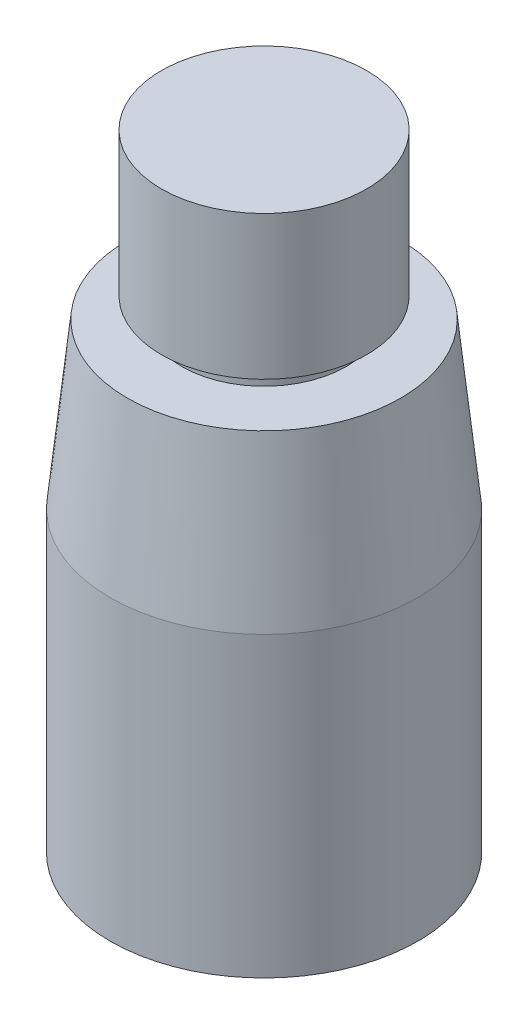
ISO-10303-21;
HEADER;
FILE_DESCRIPTION(('STEP AP214'),'2;1');
FILE_NAME('part.step','',(''),(''),'','','');
FILE_SCHEMA(('AUTOMOTIVE_DESIGN { 1 0 10303 214 1 1 1 1 }'));
ENDSEC;
DATA;
#1=APPLICATION_CONTEXT('core data for automotive mechanical design processes');
#2=APPLICATION_PROTOCOL_DEFINITION('international standard','automotive_design',2000,#1);
#3=PRODUCT_CONTEXT('',#1,'mechanical');
#4=PRODUCT('Part','Part','',(#3));
#5=PRODUCT_RELATED_PRODUCT_CATEGORY('part','',(#4));
#6=PRODUCT_DEFINITION_FORMATION('','',#4);
#7=PRODUCT_DEFINITION_CONTEXT('part definition',#1,'design');
#8=PRODUCT_DEFINITION('design','',#6,#7);
#9=PRODUCT_DEFINITION_SHAPE('','',#8);
#10=(LENGTH_UNIT() NAMED_UNIT(*) SI_UNIT(.MILLI.,.METRE.));
#11=(NAMED_UNIT(*) PLANE_ANGLE_UNIT() SI_UNIT($,.RADIAN.));
#12=(NAMED_UNIT(*) SI_UNIT($,.STERADIAN.) SOLID_ANGLE_UNIT());
#13=UNCERTAINTY_MEASURE_WITH_UNIT(LENGTH_MEASURE(1.E-05),#10,'distance_accuracy_value','');
#14=(GEOMETRIC_REPRESENTATION_CONTEXT(3) GLOBAL_UNCERTAINTY_ASSIGNED_CONTEXT((#13)) GLOBAL_UNIT_ASSIGNED_CONTEXT((#10,
#11,#12)) REPRESENTATION_CONTEXT('',''));
#15=CARTESIAN_POINT('',(0.,0.,0.));
#16=DIRECTION('',(0.,0.,1.));
#17=DIRECTION('',(1.,0.,0.));
#18=AXIS2_PLACEMENT_3D('',#15,#16,#17);
#19=CARTESIAN_POINT('',(0.,0.,0.));
#20=DIRECTION('',(0.,-1.,0.));
#21=DIRECTION('',(0.,0.,-1.));
#22=AXIS2_PLACEMENT_3D('',#19,#20,#21);
#23=PLANE('',#22);
#24=CARTESIAN_POINT('',(0.,0.,0.));
#25=DIRECTION('',(0.,1.,0.));
#26=DIRECTION('',(0.,0.,1.));
#27=AXIS2_PLACEMENT_3D('',#24,#25,#26);
#28=CIRCLE('',#27,7.5);
#29=CARTESIAN_POINT('',(0.,0.,7.5));
#30=VERTEX_POINT('',#29);
#31=EDGE_CURVE('E10',#30,#30,#28,.T.);
#32=ORIENTED_EDGE('',*,*,#31,.F.);
#33=EDGE_LOOP('',(#32));
#34=FACE_BOUND('',#33,.T.);
#35=ADVANCED_FACE('F31',(#34),#23,.T.);
#36=CARTESIAN_POINT('',(0.,85.1026449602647,0.));
#37=DIRECTION('',(0.,1.,0.));
#38=DIRECTION('',(0.,0.,1.));
#39=AXIS2_PLACEMENT_3D('',#36,#37,#38);
#40=CYLINDRICAL_SURFACE('',#39,7.5);
#41=ORIENTED_EDGE('',*,*,#31,.T.);
#42=EDGE_LOOP('',(#41));
#43=FACE_BOUND('',#42,.T.);
#44=CARTESIAN_POINT('',(0.,14.5,0.));
#45=DIRECTION('',(0.,1.,0.));
#46=DIRECTION('',(0.,0.,1.));
#47=AXIS2_PLACEMENT_3D('',#44,#45,#46);
#48=CIRCLE('',#47,7.5);
#49=CARTESIAN_POINT('',(0.,14.5,7.5));
#50=VERTEX_POINT('',#49);
#51=EDGE_CURVE('E37',#50,#50,#48,.T.);
#52=ORIENTED_EDGE('',*,*,#51,.F.);
#53=EDGE_LOOP('',(#52));
#54=FACE_BOUND('',#53,.T.);
#55=ADVANCED_FACE('F76',(#43,#54),#40,.T.);
#56=CARTESIAN_POINT('',(0.,22.5,0.));
#57=DIRECTION('',(0.,-1.,0.));
#58=DIRECTION('',(0.,0.,-1.));
#59=AXIS2_PLACEMENT_3D('',#56,#57,#58);
#60=CONICAL_SURFACE('',#59,6.65916611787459,0.10471975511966);
#61=ORIENTED_EDGE('',*,*,#51,.T.);
#62=EDGE_LOOP('',(#61));
#63=FACE_BOUND('',#62,.T.);
#64=CARTESIAN_POINT('',(0.,22.5,0.));
#65=DIRECTION('',(0.,1.,0.));
#66=DIRECTION('',(0.,0.,1.));
#67=AXIS2_PLACEMENT_3D('',#64,#65,#66);
#68=CIRCLE('',#67,6.65916611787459);
#69=CARTESIAN_POINT('',(0.,22.5,6.65916611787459));
#70=VERTEX_POINT('',#69);
#71=EDGE_CURVE('E41',#70,#70,#68,.T.);
#72=ORIENTED_EDGE('',*,*,#71,.F.);
#73=EDGE_LOOP('',(#72));
#74=FACE_BOUND('',#73,.T.);
#75=ADVANCED_FACE('F81',(#63,#74),#60,.T.);
#76=CARTESIAN_POINT('',(-6.65916611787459,22.5,0.));
#77=DIRECTION('',(0.,1.,0.));
#78=DIRECTION('',(0.,0.,1.));
#79=AXIS2_PLACEMENT_3D('',#76,#77,#78);
#80=PLANE('',#79);
#81=ORIENTED_EDGE('',*,*,#71,.T.);
#82=EDGE_LOOP('',(#81));
#83=FACE_BOUND('',#82,.T.);
#84=CARTESIAN_POINT('',(0.,22.5,0.));
#85=DIRECTION('',(0.,1.,0.));
#86=DIRECTION('',(0.,0.,1.));
#87=AXIS2_PLACEMENT_3D('',#84,#85,#86);
#88=CIRCLE('',#87,4.);
#89=CARTESIAN_POINT('',(0.,22.5,4.));
#90=VERTEX_POINT('',#89);
#91=EDGE_CURVE('E45',#90,#90,#88,.T.);
#92=ORIENTED_EDGE('',*,*,#91,.F.);
#93=EDGE_LOOP('',(#92));
#94=FACE_BOUND('',#93,.T.);
#95=ADVANCED_FACE('F85',(#83,#94),#80,.T.);
#96=CARTESIAN_POINT('',(0.,85.1026449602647,0.));
#97=DIRECTION('',(0.,1.,0.));
#98=DIRECTION('',(0.,0.,1.));
#99=AXIS2_PLACEMENT_3D('',#96,#97,#98);
#100=CYLINDRICAL_SURFACE('',#99,4.);
#101=ORIENTED_EDGE('',*,*,#91,.T.);
#102=EDGE_LOOP('',(#101));
#103=FACE_BOUND('',#102,.T.);
#104=CARTESIAN_POINT('',(0.,23.5,0.));
#105=DIRECTION('',(0.,1.,0.));
#106=DIRECTION('',(0.,0.,1.));
#107=AXIS2_PLACEMENT_3D('',#104,#105,#106);
#108=CIRCLE('',#107,4.);
#109=CARTESIAN_POINT('',(0.,23.5,4.));
#110=VERTEX_POINT('',#109);
#111=EDGE_CURVE('E50',#110,#110,#108,.T.);
#112=ORIENTED_EDGE('',*,*,#111,.F.);
#113=EDGE_LOOP('',(#112));
#114=FACE_BOUND('',#113,.T.);
#115=ADVANCED_FACE('F72',(#103,#114),#100,.T.);
#116=CARTESIAN_POINT('',(-4.,23.5,0.));
#117=DIRECTION('',(0.,-1.,0.));
#118=DIRECTION('',(0.,0.,-1.));
#119=AXIS2_PLACEMENT_3D('',#116,#117,#118);
#120=PLANE('',#119);
#121=ORIENTED_EDGE('',*,*,#111,.T.);
#122=EDGE_LOOP('',(#121));
#123=FACE_BOUND('',#122,.T.);
#124=CARTESIAN_POINT('',(0.,23.5,0.));
#125=DIRECTION('',(0.,1.,0.));
#126=DIRECTION('',(0.,0.,1.));
#127=AXIS2_PLACEMENT_3D('',#124,#125,#126);
#128=CIRCLE('',#127,5.);
#129=CARTESIAN_POINT('',(0.,23.5,5.));
#130=VERTEX_POINT('',#129);
#131=EDGE_CURVE('E53',#130,#130,#128,.T.);
#132=ORIENTED_EDGE('',*,*,#131,.F.);
#133=EDGE_LOOP('',(#132));
#134=FACE_BOUND('',#133,.T.);
#135=ADVANCED_FACE('F64',(#123,#134),#120,.T.);
#136=CARTESIAN_POINT('',(0.,85.1026449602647,0.));
#137=DIRECTION('',(0.,1.,0.));
#138=DIRECTION('',(0.,0.,1.));
#139=AXIS2_PLACEMENT_3D('',#136,#137,#138);
#140=CYLINDRICAL_SURFACE('',#139,5.);
#141=ORIENTED_EDGE('',*,*,#131,.T.);
#142=EDGE_LOOP('',(#141));
#143=FACE_BOUND('',#142,.T.);
#144=CARTESIAN_POINT('',(0.,30.5,0.));
#145=DIRECTION('',(0.,1.,0.));
#146=DIRECTION('',(0.,0.,1.));
#147=AXIS2_PLACEMENT_3D('',#144,#145,#146);
#148=CIRCLE('',#147,5.);
#149=CARTESIAN_POINT('',(0.,30.5,5.));
#150=VERTEX_POINT('',#149);
#151=EDGE_CURVE('E56',#150,#150,#148,.T.);
#152=ORIENTED_EDGE('',*,*,#151,.F.);
#153=EDGE_LOOP('',(#152));
#154=FACE_BOUND('',#153,.T.);
#155=ADVANCED_FACE('F62',(#143,#154),#140,.T.);
#156=CARTESIAN_POINT('',(-5.,30.5,0.));
#157=DIRECTION('',(0.,1.,0.));
#158=DIRECTION('',(0.,0.,1.));
#159=AXIS2_PLACEMENT_3D('',#156,#157,#158);
#160=PLANE('',#159);
#161=ORIENTED_EDGE('',*,*,#151,.T.);
#162=EDGE_LOOP('',(#161));
#163=FACE_BOUND('',#162,.T.);
#164=ADVANCED_FACE('F60',(#163),#160,.T.);
#165=CLOSED_SHELL('',(#35,#55,#75,#95,#115,#135,#155,#164));
#166=MANIFOLD_SOLID_BREP('B2',#165);
#167=ADVANCED_BREP_SHAPE_REPRESENTATION('',(#18,#166),#14);
#168=SHAPE_DEFINITION_REPRESENTATION(#9,#167);
ENDSEC;
END-ISO-10303-21;
